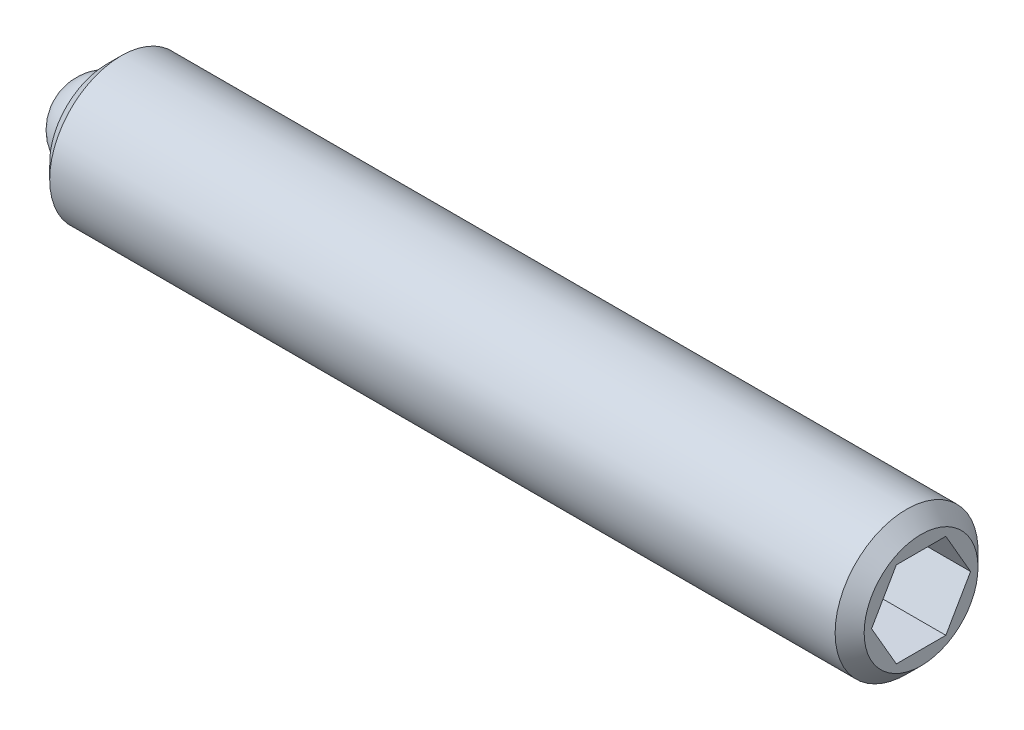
ISO-10303-21;
HEADER;
FILE_DESCRIPTION(('STEP AP214'),'2;1');
FILE_NAME('part.step','',(''),(''),'','','');
FILE_SCHEMA(('AUTOMOTIVE_DESIGN { 1 0 10303 214 1 1 1 1 }'));
ENDSEC;
DATA;
#1=APPLICATION_CONTEXT('core data for automotive mechanical design processes');
#2=APPLICATION_PROTOCOL_DEFINITION('international standard','automotive_design',2000,#1);
#3=PRODUCT_CONTEXT('',#1,'mechanical');
#4=PRODUCT('Part','Part','',(#3));
#5=PRODUCT_RELATED_PRODUCT_CATEGORY('part','',(#4));
#6=PRODUCT_DEFINITION_FORMATION('','',#4);
#7=PRODUCT_DEFINITION_CONTEXT('part definition',#1,'design');
#8=PRODUCT_DEFINITION('design','',#6,#7);
#9=PRODUCT_DEFINITION_SHAPE('','',#8);
#10=(LENGTH_UNIT() NAMED_UNIT(*) SI_UNIT(.MILLI.,.METRE.));
#11=(NAMED_UNIT(*) PLANE_ANGLE_UNIT() SI_UNIT($,.RADIAN.));
#12=(NAMED_UNIT(*) SI_UNIT($,.STERADIAN.) SOLID_ANGLE_UNIT());
#13=UNCERTAINTY_MEASURE_WITH_UNIT(LENGTH_MEASURE(1.E-05),#10,'distance_accuracy_value','');
#14=(GEOMETRIC_REPRESENTATION_CONTEXT(3) GLOBAL_UNCERTAINTY_ASSIGNED_CONTEXT((#13)) GLOBAL_UNIT_ASSIGNED_CONTEXT((#10,
#11,#12)) REPRESENTATION_CONTEXT('',''));
#15=CARTESIAN_POINT('',(0.,0.,0.));
#16=DIRECTION('',(0.,0.,1.));
#17=DIRECTION('',(1.,0.,0.));
#18=AXIS2_PLACEMENT_3D('',#15,#16,#17);
#19=CARTESIAN_POINT('',(0.,0.,0.));
#20=DIRECTION('',(0.,-1.,0.));
#21=DIRECTION('',(0.,0.,-1.));
#22=AXIS2_PLACEMENT_3D('',#19,#20,#21);
#23=SPHERICAL_SURFACE('',#22,0.75);
#24=CARTESIAN_POINT('',(0.,-0.75,0.));
#25=VERTEX_POINT('',#24);
#26=VERTEX_LOOP('',#25);
#27=FACE_BOUND('',#26,.T.);
#28=ADVANCED_FACE('F43',(#27),#23,.T.);
#29=CLOSED_SHELL('',(#28));
#30=MANIFOLD_SOLID_BREP('B2',#29);
#31=CARTESIAN_POINT('',(14.25,0.,0.));
#32=DIRECTION('',(-1.,0.,0.));
#33=DIRECTION('',(0.,0.,1.));
#34=AXIS2_PLACEMENT_3D('',#31,#32,#33);
#35=CYLINDRICAL_SURFACE('',#34,1.25);
#36=CARTESIAN_POINT('',(13.996,0.,0.));
#37=DIRECTION('',(1.,0.,0.));
#38=DIRECTION('',(0.,0.,-1.));
#39=AXIS2_PLACEMENT_3D('',#36,#37,#38);
#40=CIRCLE('',#39,1.25);
#41=CARTESIAN_POINT('',(13.996,0.,1.25));
#42=VERTEX_POINT('',#41);
#43=EDGE_CURVE('E41',#42,#42,#40,.F.);
#44=CARTESIAN_POINT('',(0.254000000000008,0.,0.));
#45=DIRECTION('',(1.,0.,0.));
#46=DIRECTION('',(0.,0.,-1.));
#47=AXIS2_PLACEMENT_3D('',#44,#45,#46);
#48=CIRCLE('',#47,1.25);
#49=CARTESIAN_POINT('',(0.254000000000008,0.,1.25));
#50=VERTEX_POINT('',#49);
#51=EDGE_CURVE('E159',#50,#50,#48,.T.);
#52=CARTESIAN_POINT('',(13.996,0.,1.25));
#53=CARTESIAN_POINT('',(13.8528541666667,0.,1.25));
#54=CARTESIAN_POINT('',(13.7097083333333,0.,1.25));
#55=CARTESIAN_POINT('',(13.4234166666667,0.,1.25));
#56=CARTESIAN_POINT('',(13.2802708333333,0.,1.25));
#57=CARTESIAN_POINT('',(12.9939791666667,0.,1.25));
#58=CARTESIAN_POINT('',(12.8508333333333,0.,1.25));
#59=CARTESIAN_POINT('',(12.5645416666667,0.,1.25));
#60=CARTESIAN_POINT('',(12.4213958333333,0.,1.25));
#61=CARTESIAN_POINT('',(12.1351041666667,0.,1.25));
#62=CARTESIAN_POINT('',(11.9919583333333,0.,1.25));
#63=CARTESIAN_POINT('',(11.7056666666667,0.,1.25));
#64=CARTESIAN_POINT('',(11.5625208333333,0.,1.25));
#65=CARTESIAN_POINT('',(11.2762291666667,0.,1.25));
#66=CARTESIAN_POINT('',(11.1330833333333,0.,1.25));
#67=CARTESIAN_POINT('',(10.8467916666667,0.,1.25));
#68=CARTESIAN_POINT('',(10.7036458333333,0.,1.25));
#69=CARTESIAN_POINT('',(10.4173541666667,0.,1.25));
#70=CARTESIAN_POINT('',(10.2742083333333,0.,1.25));
#71=CARTESIAN_POINT('',(9.98791666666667,0.,1.25));
#72=CARTESIAN_POINT('',(9.84477083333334,0.,1.25));
#73=CARTESIAN_POINT('',(9.55847916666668,0.,1.25));
#74=CARTESIAN_POINT('',(9.41533333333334,0.,1.25));
#75=CARTESIAN_POINT('',(9.12904166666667,0.,1.25));
#76=CARTESIAN_POINT('',(8.98589583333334,0.,1.25));
#77=CARTESIAN_POINT('',(8.69960416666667,0.,1.25));
#78=CARTESIAN_POINT('',(8.55645833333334,0.,1.25));
#79=CARTESIAN_POINT('',(8.27016666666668,0.,1.25));
#80=CARTESIAN_POINT('',(8.12702083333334,0.,1.25));
#81=CARTESIAN_POINT('',(7.84072916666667,0.,1.25));
#82=CARTESIAN_POINT('',(7.69758333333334,0.,1.25));
#83=CARTESIAN_POINT('',(7.41129166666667,0.,1.25));
#84=CARTESIAN_POINT('',(7.26814583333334,0.,1.25));
#85=CARTESIAN_POINT('',(6.98185416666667,0.,1.25));
#86=CARTESIAN_POINT('',(6.83870833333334,0.,1.25));
#87=CARTESIAN_POINT('',(6.55241666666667,0.,1.25));
#88=CARTESIAN_POINT('',(6.40927083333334,0.,1.25));
#89=CARTESIAN_POINT('',(6.12297916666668,0.,1.25));
#90=CARTESIAN_POINT('',(5.97983333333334,0.,1.25));
#91=CARTESIAN_POINT('',(5.69354166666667,0.,1.25));
#92=CARTESIAN_POINT('',(5.55039583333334,0.,1.25));
#93=CARTESIAN_POINT('',(5.26410416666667,0.,1.25));
#94=CARTESIAN_POINT('',(5.12095833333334,0.,1.25));
#95=CARTESIAN_POINT('',(4.83466666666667,0.,1.25));
#96=CARTESIAN_POINT('',(4.69152083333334,0.,1.25));
#97=CARTESIAN_POINT('',(4.40522916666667,0.,1.25));
#98=CARTESIAN_POINT('',(4.26208333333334,0.,1.25));
#99=CARTESIAN_POINT('',(3.97579166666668,0.,1.25));
#100=CARTESIAN_POINT('',(3.83264583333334,0.,1.25));
#101=CARTESIAN_POINT('',(3.54635416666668,0.,1.25));
#102=CARTESIAN_POINT('',(3.40320833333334,0.,1.25));
#103=CARTESIAN_POINT('',(3.11691666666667,0.,1.25));
#104=CARTESIAN_POINT('',(2.97377083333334,0.,1.25));
#105=CARTESIAN_POINT('',(2.68747916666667,0.,1.25));
#106=CARTESIAN_POINT('',(2.54433333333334,0.,1.25));
#107=CARTESIAN_POINT('',(2.25804166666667,0.,1.25));
#108=CARTESIAN_POINT('',(2.11489583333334,0.,1.25));
#109=CARTESIAN_POINT('',(1.82860416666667,0.,1.25));
#110=CARTESIAN_POINT('',(1.68545833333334,0.,1.25));
#111=CARTESIAN_POINT('',(1.39916666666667,0.,1.25));
#112=CARTESIAN_POINT('',(1.25602083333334,0.,1.25));
#113=CARTESIAN_POINT('',(0.969729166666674,0.,1.25));
#114=CARTESIAN_POINT('',(0.826583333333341,0.,1.25));
#115=CARTESIAN_POINT('',(0.540291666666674,0.,1.25));
#116=CARTESIAN_POINT('',(0.39714583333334,0.,1.25));
#117=CARTESIAN_POINT('',(0.254000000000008,0.,1.25));
#118=B_SPLINE_CURVE_WITH_KNOTS('',3,(#52,#53,#54,#55,#56,#57,#58,#59,#60,#61,#62,#63,#64,#65,
#66,#67,#68,#69,#70,#71,#72,#73,#74,#75,#76,#77,#78,#79,#80,#81,#82,#83,#84,#85,#86,#87,#88,#89,
#90,#91,#92,#93,#94,#95,#96,#97,#98,#99,#100,#101,#102,#103,#104,#105,#106,#107,#108,#109,#110,
#111,#112,#113,#114,#115,#116,#117),.UNSPECIFIED.,.F.,.F.,(4,2,2,2,2,2,2,2,2,2,2,2,2,2,2,2,2,2,
2,2,2,2,2,2,2,2,2,2,2,2,2,2,4),(0.,0.429437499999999,0.858874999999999,1.2883125,1.71775,
2.1471875,2.576625,3.0060625,3.4355,3.8649375,4.294375,4.7238125,5.15325,5.5826875,6.012125,
6.4415625,6.871,7.3004375,7.729875,8.1593125,8.58875,9.0181875,9.447625,9.8770625,10.3065,
10.7359375,11.165375,11.5948125,12.02425,12.4536875,12.883125,13.3125625,13.742),.UNSPECIFIED.);
#119=EDGE_CURVE('BSEAM56',#42,#50,#118,.T.);
#120=ORIENTED_EDGE('',*,*,#43,.T.);
#121=ORIENTED_EDGE('',*,*,#51,.T.);
#122=ORIENTED_EDGE('',*,*,#119,.T.);
#123=ORIENTED_EDGE('',*,*,#119,.F.);
#124=EDGE_LOOP('',(#120,#122,#121,#123));
#125=FACE_BOUND('',#124,.T.);
#126=ADVANCED_FACE('F56',(#125),#35,.T.);
#127=CARTESIAN_POINT('',(14.25,0.,0.));
#128=DIRECTION('',(1.,0.,0.));
#129=DIRECTION('',(0.,0.,-1.));
#130=AXIS2_PLACEMENT_3D('',#127,#128,#129);
#131=PLANE('',#130);
#132=DIRECTION('',(0.,0.866025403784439,-0.5));
#133=VECTOR('',#132,1.);
#134=CARTESIAN_POINT('',(14.25,-0.75,-0.43301270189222));
#135=LINE('',#134,#133);
#136=CARTESIAN_POINT('',(14.25,-0.75,-0.43301270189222));
#137=VERTEX_POINT('',#136);
#138=CARTESIAN_POINT('',(14.25,0.,-0.866025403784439));
#139=VERTEX_POINT('',#138);
#140=EDGE_CURVE('E71',#137,#139,#135,.T.);
#141=ORIENTED_EDGE('',*,*,#140,.F.);
#142=DIRECTION('',(0.,0.,-1.));
#143=VECTOR('',#142,1.);
#144=CARTESIAN_POINT('',(14.25,-0.75,0.433012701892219));
#145=LINE('',#144,#143);
#146=CARTESIAN_POINT('',(14.25,-0.75,0.433012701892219));
#147=VERTEX_POINT('',#146);
#148=EDGE_CURVE('E155',#147,#137,#145,.T.);
#149=ORIENTED_EDGE('',*,*,#148,.F.);
#150=DIRECTION('',(0.,-0.866025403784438,-0.5));
#151=VECTOR('',#150,1.);
#152=CARTESIAN_POINT('',(14.25,0.,0.866025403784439));
#153=LINE('',#152,#151);
#154=CARTESIAN_POINT('',(14.25,0.,0.866025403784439));
#155=VERTEX_POINT('',#154);
#156=EDGE_CURVE('E153',#155,#147,#153,.T.);
#157=ORIENTED_EDGE('',*,*,#156,.F.);
#158=DIRECTION('',(0.,-0.866025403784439,0.5));
#159=VECTOR('',#158,1.);
#160=CARTESIAN_POINT('',(14.25,0.75,0.433012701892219));
#161=LINE('',#160,#159);
#162=CARTESIAN_POINT('',(14.25,0.75,0.433012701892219));
#163=VERTEX_POINT('',#162);
#164=EDGE_CURVE('E119',#163,#155,#161,.T.);
#165=ORIENTED_EDGE('',*,*,#164,.F.);
#166=DIRECTION('',(0.,0.,1.));
#167=VECTOR('',#166,1.);
#168=CARTESIAN_POINT('',(14.25,0.75,-0.433012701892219));
#169=LINE('',#168,#167);
#170=CARTESIAN_POINT('',(14.25,0.75,-0.433012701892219));
#171=VERTEX_POINT('',#170);
#172=EDGE_CURVE('E149',#171,#163,#169,.T.);
#173=ORIENTED_EDGE('',*,*,#172,.F.);
#174=DIRECTION('',(0.,0.866025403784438,0.5));
#175=VECTOR('',#174,1.);
#176=CARTESIAN_POINT('',(14.25,0.,-0.866025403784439));
#177=LINE('',#176,#175);
#178=EDGE_CURVE('E145',#139,#171,#177,.T.);
#179=ORIENTED_EDGE('',*,*,#178,.F.);
#180=EDGE_LOOP('',(#141,#149,#157,#165,#173,#179));
#181=FACE_BOUND('',#180,.T.);
#182=CARTESIAN_POINT('',(14.25,0.,0.));
#183=DIRECTION('',(1.,0.,0.));
#184=DIRECTION('',(0.,0.,-1.));
#185=AXIS2_PLACEMENT_3D('',#182,#183,#184);
#186=CIRCLE('',#185,0.996000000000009);
#187=CARTESIAN_POINT('',(14.25,0.,-0.996000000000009));
#188=VERTEX_POINT('',#187);
#189=EDGE_CURVE('E64',#188,#188,#186,.T.);
#190=ORIENTED_EDGE('',*,*,#189,.T.);
#191=EDGE_LOOP('',(#190));
#192=FACE_BOUND('',#191,.T.);
#193=ADVANCED_FACE('F172',(#181,#192),#131,.T.);
#194=CARTESIAN_POINT('',(0.,0.,0.));
#195=DIRECTION('',(1.,0.,0.));
#196=DIRECTION('',(0.,0.,-1.));
#197=AXIS2_PLACEMENT_3D('',#194,#195,#196);
#198=PLANE('',#197);
#199=CARTESIAN_POINT('',(0.,0.,0.));
#200=DIRECTION('',(-1.,0.,0.));
#201=DIRECTION('',(0.,0.,1.));
#202=AXIS2_PLACEMENT_3D('',#199,#200,#201);
#203=CIRCLE('',#202,0.75);
#204=CARTESIAN_POINT('',(0.,0.,0.75));
#205=VERTEX_POINT('',#204);
#206=EDGE_CURVE('E227',#205,#205,#203,.T.);
#207=ORIENTED_EDGE('',*,*,#206,.F.);
#208=EDGE_LOOP('',(#207));
#209=FACE_BOUND('',#208,.T.);
#210=CARTESIAN_POINT('',(0.,0.,0.));
#211=DIRECTION('',(1.,0.,0.));
#212=DIRECTION('',(0.,0.,-1.));
#213=AXIS2_PLACEMENT_3D('',#210,#211,#212);
#214=CIRCLE('',#213,0.995999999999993);
#215=CARTESIAN_POINT('',(0.,0.,-0.995999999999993));
#216=VERTEX_POINT('',#215);
#217=EDGE_CURVE('E167',#216,#216,#214,.F.);
#218=ORIENTED_EDGE('',*,*,#217,.T.);
#219=EDGE_LOOP('',(#218));
#220=FACE_BOUND('',#219,.T.);
#221=ADVANCED_FACE('F184',(#209,#220),#198,.F.);
#222=CARTESIAN_POINT('',(0.254000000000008,0.,0.));
#223=DIRECTION('',(1.,0.,0.));
#224=DIRECTION('',(0.,0.,-1.));
#225=AXIS2_PLACEMENT_3D('',#222,#223,#224);
#226=CONICAL_SURFACE('',#225,1.25,0.785398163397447);
#227=ORIENTED_EDGE('',*,*,#217,.F.);
#228=EDGE_LOOP('',(#227));
#229=FACE_BOUND('',#228,.T.);
#230=ORIENTED_EDGE('',*,*,#51,.F.);
#231=EDGE_LOOP('',(#230));
#232=FACE_BOUND('',#231,.T.);
#233=ADVANCED_FACE('F176',(#229,#232),#226,.T.);
#234=CARTESIAN_POINT('',(14.25,0.,0.));
#235=DIRECTION('',(-1.,0.,0.));
#236=DIRECTION('',(0.,0.,1.));
#237=AXIS2_PLACEMENT_3D('',#234,#235,#236);
#238=CONICAL_SURFACE('',#237,0.996000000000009,0.785398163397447);
#239=ORIENTED_EDGE('',*,*,#43,.F.);
#240=EDGE_LOOP('',(#239));
#241=FACE_BOUND('',#240,.T.);
#242=ORIENTED_EDGE('',*,*,#189,.F.);
#243=EDGE_LOOP('',(#242));
#244=FACE_BOUND('',#243,.T.);
#245=ADVANCED_FACE('F58',(#241,#244),#238,.T.);
#246=CARTESIAN_POINT('',(12.25,-0.75,-0.43301270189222));
#247=DIRECTION('',(0.,-0.5,-0.866025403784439));
#248=DIRECTION('',(0.,0.866025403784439,-0.5));
#249=AXIS2_PLACEMENT_3D('',#246,#247,#248);
#250=PLANE('',#249);
#251=ORIENTED_EDGE('',*,*,#140,.T.);
#252=DIRECTION('',(1.,0.,0.));
#253=VECTOR('',#252,1.);
#254=CARTESIAN_POINT('',(12.25,0.,-0.866025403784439));
#255=LINE('',#254,#253);
#256=CARTESIAN_POINT('',(12.25,0.,-0.866025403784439));
#257=VERTEX_POINT('',#256);
#258=EDGE_CURVE('E101',#257,#139,#255,.T.);
#259=ORIENTED_EDGE('',*,*,#258,.F.);
#260=DIRECTION('',(0.,0.866025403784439,-0.5));
#261=VECTOR('',#260,1.);
#262=CARTESIAN_POINT('',(12.25,-0.75,-0.43301270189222));
#263=LINE('',#262,#261);
#264=CARTESIAN_POINT('',(12.25,-0.75,-0.43301270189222));
#265=VERTEX_POINT('',#264);
#266=EDGE_CURVE('E157',#265,#257,#263,.T.);
#267=ORIENTED_EDGE('',*,*,#266,.F.);
#268=DIRECTION('',(1.,0.,0.));
#269=VECTOR('',#268,1.);
#270=CARTESIAN_POINT('',(12.25,-0.75,-0.43301270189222));
#271=LINE('',#270,#269);
#272=EDGE_CURVE('E79',#265,#137,#271,.T.);
#273=ORIENTED_EDGE('',*,*,#272,.T.);
#274=EDGE_LOOP('',(#251,#259,#267,#273));
#275=FACE_BOUND('',#274,.T.);
#276=ADVANCED_FACE('F175',(#275),#250,.F.);
#277=CARTESIAN_POINT('',(12.25,-0.75,0.433012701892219));
#278=DIRECTION('',(0.,-1.,0.));
#279=DIRECTION('',(0.,0.,-1.));
#280=AXIS2_PLACEMENT_3D('',#277,#278,#279);
#281=PLANE('',#280);
#282=ORIENTED_EDGE('',*,*,#148,.T.);
#283=ORIENTED_EDGE('',*,*,#272,.F.);
#284=DIRECTION('',(0.,0.,-1.));
#285=VECTOR('',#284,1.);
#286=CARTESIAN_POINT('',(12.25,-0.75,0.433012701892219));
#287=LINE('',#286,#285);
#288=CARTESIAN_POINT('',(12.25,-0.75,0.433012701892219));
#289=VERTEX_POINT('',#288);
#290=EDGE_CURVE('E131',#289,#265,#287,.T.);
#291=ORIENTED_EDGE('',*,*,#290,.F.);
#292=DIRECTION('',(1.,0.,0.));
#293=VECTOR('',#292,1.);
#294=CARTESIAN_POINT('',(12.25,-0.75,0.433012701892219));
#295=LINE('',#294,#293);
#296=EDGE_CURVE('E123',#289,#147,#295,.T.);
#297=ORIENTED_EDGE('',*,*,#296,.T.);
#298=EDGE_LOOP('',(#282,#283,#291,#297));
#299=FACE_BOUND('',#298,.T.);
#300=ADVANCED_FACE('F182',(#299),#281,.F.);
#301=CARTESIAN_POINT('',(12.25,0.,0.866025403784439));
#302=DIRECTION('',(0.,-0.5,0.866025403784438));
#303=DIRECTION('',(0.,-0.866025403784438,-0.5));
#304=AXIS2_PLACEMENT_3D('',#301,#302,#303);
#305=PLANE('',#304);
#306=ORIENTED_EDGE('',*,*,#156,.T.);
#307=ORIENTED_EDGE('',*,*,#296,.F.);
#308=DIRECTION('',(0.,-0.866025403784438,-0.5));
#309=VECTOR('',#308,1.);
#310=CARTESIAN_POINT('',(12.25,0.,0.866025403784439));
#311=LINE('',#310,#309);
#312=CARTESIAN_POINT('',(12.25,0.,0.866025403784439));
#313=VERTEX_POINT('',#312);
#314=EDGE_CURVE('E127',#313,#289,#311,.T.);
#315=ORIENTED_EDGE('',*,*,#314,.F.);
#316=DIRECTION('',(1.,0.,0.));
#317=VECTOR('',#316,1.);
#318=CARTESIAN_POINT('',(12.25,0.,0.866025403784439));
#319=LINE('',#318,#317);
#320=EDGE_CURVE('E112',#313,#155,#319,.T.);
#321=ORIENTED_EDGE('',*,*,#320,.T.);
#322=EDGE_LOOP('',(#306,#307,#315,#321));
#323=FACE_BOUND('',#322,.T.);
#324=ADVANCED_FACE('F128',(#323),#305,.F.);
#325=CARTESIAN_POINT('',(12.25,0.75,0.433012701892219));
#326=DIRECTION('',(0.,0.5,0.866025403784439));
#327=DIRECTION('',(0.,-0.866025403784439,0.5));
#328=AXIS2_PLACEMENT_3D('',#325,#326,#327);
#329=PLANE('',#328);
#330=ORIENTED_EDGE('',*,*,#164,.T.);
#331=ORIENTED_EDGE('',*,*,#320,.F.);
#332=DIRECTION('',(0.,-0.866025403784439,0.5));
#333=VECTOR('',#332,1.);
#334=CARTESIAN_POINT('',(12.25,0.75,0.433012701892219));
#335=LINE('',#334,#333);
#336=CARTESIAN_POINT('',(12.25,0.75,0.433012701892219));
#337=VERTEX_POINT('',#336);
#338=EDGE_CURVE('E116',#337,#313,#335,.T.);
#339=ORIENTED_EDGE('',*,*,#338,.F.);
#340=DIRECTION('',(1.,0.,0.));
#341=VECTOR('',#340,1.);
#342=CARTESIAN_POINT('',(12.25,0.75,0.433012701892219));
#343=LINE('',#342,#341);
#344=EDGE_CURVE('E124',#337,#163,#343,.T.);
#345=ORIENTED_EDGE('',*,*,#344,.T.);
#346=EDGE_LOOP('',(#330,#331,#339,#345));
#347=FACE_BOUND('',#346,.T.);
#348=ADVANCED_FACE('F114',(#347),#329,.F.);
#349=CARTESIAN_POINT('',(12.25,0.75,-0.433012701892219));
#350=DIRECTION('',(0.,1.,0.));
#351=DIRECTION('',(0.,0.,1.));
#352=AXIS2_PLACEMENT_3D('',#349,#350,#351);
#353=PLANE('',#352);
#354=ORIENTED_EDGE('',*,*,#172,.T.);
#355=ORIENTED_EDGE('',*,*,#344,.F.);
#356=DIRECTION('',(0.,0.,1.));
#357=VECTOR('',#356,1.);
#358=CARTESIAN_POINT('',(12.25,0.75,-0.433012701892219));
#359=LINE('',#358,#357);
#360=CARTESIAN_POINT('',(12.25,0.75,-0.433012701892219));
#361=VERTEX_POINT('',#360);
#362=EDGE_CURVE('E137',#361,#337,#359,.T.);
#363=ORIENTED_EDGE('',*,*,#362,.F.);
#364=DIRECTION('',(1.,0.,0.));
#365=VECTOR('',#364,1.);
#366=CARTESIAN_POINT('',(12.25,0.75,-0.433012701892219));
#367=LINE('',#366,#365);
#368=EDGE_CURVE('E162',#361,#171,#367,.T.);
#369=ORIENTED_EDGE('',*,*,#368,.T.);
#370=EDGE_LOOP('',(#354,#355,#363,#369));
#371=FACE_BOUND('',#370,.T.);
#372=ADVANCED_FACE('F203',(#371),#353,.F.);
#373=CARTESIAN_POINT('',(12.25,0.,-0.866025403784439));
#374=DIRECTION('',(0.,0.500000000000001,-0.866025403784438));
#375=DIRECTION('',(0.,0.866025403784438,0.500000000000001));
#376=AXIS2_PLACEMENT_3D('',#373,#374,#375);
#377=PLANE('',#376);
#378=ORIENTED_EDGE('',*,*,#178,.T.);
#379=ORIENTED_EDGE('',*,*,#368,.F.);
#380=DIRECTION('',(0.,0.866025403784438,0.5));
#381=VECTOR('',#380,1.);
#382=CARTESIAN_POINT('',(12.25,0.,-0.866025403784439));
#383=LINE('',#382,#381);
#384=EDGE_CURVE('E139',#257,#361,#383,.T.);
#385=ORIENTED_EDGE('',*,*,#384,.F.);
#386=ORIENTED_EDGE('',*,*,#258,.T.);
#387=EDGE_LOOP('',(#378,#379,#385,#386));
#388=FACE_BOUND('',#387,.T.);
#389=ADVANCED_FACE('F200',(#388),#377,.F.);
#390=CARTESIAN_POINT('',(12.25,0.,0.));
#391=DIRECTION('',(1.,0.,0.));
#392=DIRECTION('',(0.,0.,-1.));
#393=AXIS2_PLACEMENT_3D('',#390,#391,#392);
#394=PLANE('',#393);
#395=ORIENTED_EDGE('',*,*,#266,.T.);
#396=ORIENTED_EDGE('',*,*,#384,.T.);
#397=ORIENTED_EDGE('',*,*,#362,.T.);
#398=ORIENTED_EDGE('',*,*,#338,.T.);
#399=ORIENTED_EDGE('',*,*,#314,.T.);
#400=ORIENTED_EDGE('',*,*,#290,.T.);
#401=EDGE_LOOP('',(#395,#396,#397,#398,#399,#400));
#402=FACE_BOUND('',#401,.T.);
#403=ADVANCED_FACE('F134',(#402),#394,.T.);
#404=CARTESIAN_POINT('',(0.8,0.,0.));
#405=DIRECTION('',(-1.,0.,0.));
#406=DIRECTION('',(0.,0.,1.));
#407=AXIS2_PLACEMENT_3D('',#404,#405,#406);
#408=CYLINDRICAL_SURFACE('',#407,0.75);
#409=CARTESIAN_POINT('',(0.8,0.,0.));
#410=DIRECTION('',(-1.,0.,0.));
#411=DIRECTION('',(0.,0.,1.));
#412=AXIS2_PLACEMENT_3D('',#409,#410,#411);
#413=CIRCLE('',#412,0.75);
#414=CARTESIAN_POINT('',(0.8,0.,0.75));
#415=VERTEX_POINT('',#414);
#416=EDGE_CURVE('E146',#415,#415,#413,.T.);
#417=ORIENTED_EDGE('',*,*,#416,.F.);
#418=EDGE_LOOP('',(#417));
#419=FACE_BOUND('',#418,.T.);
#420=ORIENTED_EDGE('',*,*,#206,.T.);
#421=EDGE_LOOP('',(#420));
#422=FACE_BOUND('',#421,.T.);
#423=ADVANCED_FACE('F216',(#419,#422),#408,.F.);
#424=CARTESIAN_POINT('',(0.8,0.,0.));
#425=DIRECTION('',(-1.,0.,0.));
#426=DIRECTION('',(0.,0.,1.));
#427=AXIS2_PLACEMENT_3D('',#424,#425,#426);
#428=PLANE('',#427);
#429=ORIENTED_EDGE('',*,*,#416,.T.);
#430=EDGE_LOOP('',(#429));
#431=FACE_BOUND('',#430,.T.);
#432=ADVANCED_FACE('F219',(#431),#428,.T.);
#433=CLOSED_SHELL('',(#126,#193,#221,#233,#245,#276,#300,#324,#348,#372,#389,#403,#423,#432));
#434=MANIFOLD_SOLID_BREP('B6',#433);
#435=ADVANCED_BREP_SHAPE_REPRESENTATION('',(#18,#30,#434),#14);
#436=SHAPE_DEFINITION_REPRESENTATION(#9,#435);
ENDSEC;
END-ISO-10303-21;
